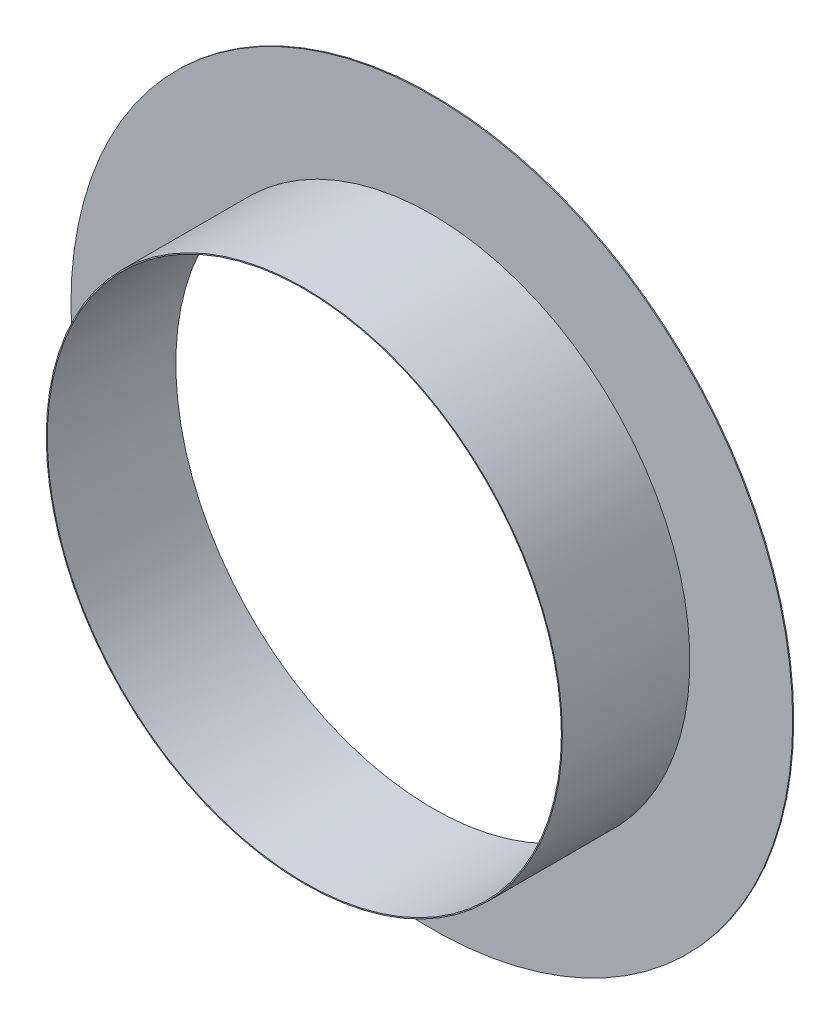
from build123d import *

# Parameters (mm, degrees)
SKETCH1_R           = 502
SKETCH1_R_2         = 500
EXTRUDE_THIN1_DEPTH = 250
SKETCH2_R           = 702
SKETCH2_R_2         = 502
BOSS_EXTRUDE2_DEPTH = 2


with BuildPart() as part:
    # Sketch1 → Extrude-Thin1 (new body)
    with BuildSketch(Plane.XY):
        Circle(SKETCH1_R)
        Circle(SKETCH1_R_2, mode=Mode.SUBTRACT)
    extrude(amount=EXTRUDE_THIN1_DEPTH)

    # Sketch2 → Boss-Extrude2 (add)
    with BuildSketch(Plane(origin=(0, 0, 0), x_dir=(-1, 0, 0), z_dir=(0, 0, -1))):
        Circle(SKETCH2_R)
        Circle(SKETCH2_R_2, mode=Mode.SUBTRACT)
    extrude(amount=-BOSS_EXTRUDE2_DEPTH)


solid = part.part
